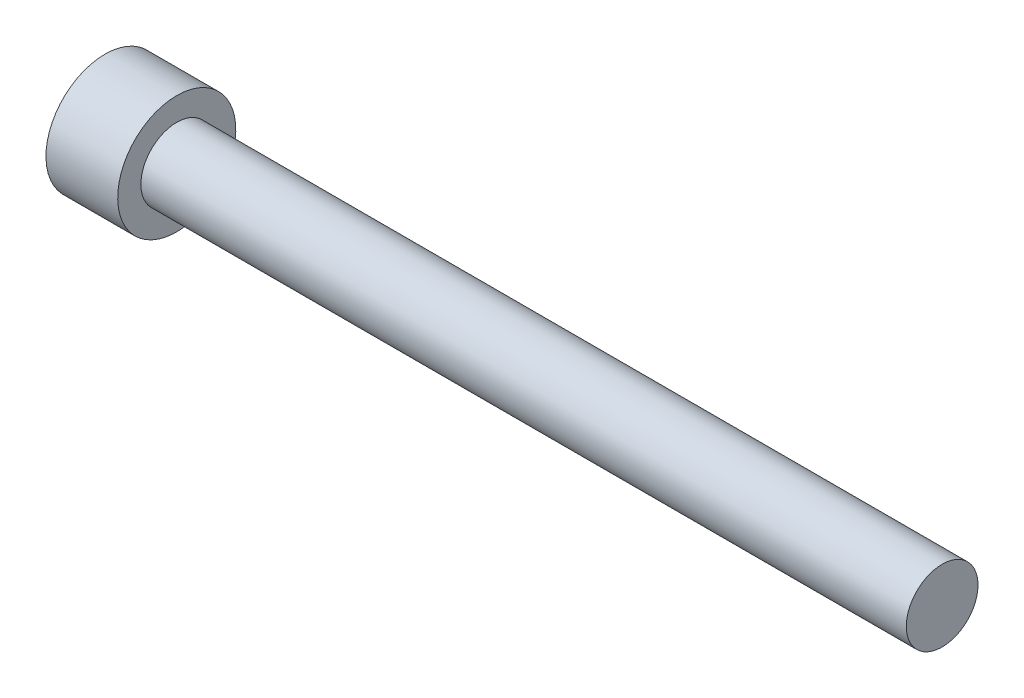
ISO-10303-21;
HEADER;
FILE_DESCRIPTION(('STEP AP214'),'2;1');
FILE_NAME('part.step','',(''),(''),'','','');
FILE_SCHEMA(('AUTOMOTIVE_DESIGN { 1 0 10303 214 1 1 1 1 }'));
ENDSEC;
DATA;
#1=APPLICATION_CONTEXT('core data for automotive mechanical design processes');
#2=APPLICATION_PROTOCOL_DEFINITION('international standard','automotive_design',2000,#1);
#3=PRODUCT_CONTEXT('',#1,'mechanical');
#4=PRODUCT('Part','Part','',(#3));
#5=PRODUCT_RELATED_PRODUCT_CATEGORY('part','',(#4));
#6=PRODUCT_DEFINITION_FORMATION('','',#4);
#7=PRODUCT_DEFINITION_CONTEXT('part definition',#1,'design');
#8=PRODUCT_DEFINITION('design','',#6,#7);
#9=PRODUCT_DEFINITION_SHAPE('','',#8);
#10=(LENGTH_UNIT() NAMED_UNIT(*) SI_UNIT(.MILLI.,.METRE.));
#11=(NAMED_UNIT(*) PLANE_ANGLE_UNIT() SI_UNIT($,.RADIAN.));
#12=(NAMED_UNIT(*) SI_UNIT($,.STERADIAN.) SOLID_ANGLE_UNIT());
#13=UNCERTAINTY_MEASURE_WITH_UNIT(LENGTH_MEASURE(1.E-05),#10,'distance_accuracy_value','');
#14=(GEOMETRIC_REPRESENTATION_CONTEXT(3) GLOBAL_UNCERTAINTY_ASSIGNED_CONTEXT((#13)) GLOBAL_UNIT_ASSIGNED_CONTEXT((#10,
#11,#12)) REPRESENTATION_CONTEXT('',''));
#15=CARTESIAN_POINT('',(0.,0.,0.));
#16=DIRECTION('',(0.,0.,1.));
#17=DIRECTION('',(1.,0.,0.));
#18=AXIS2_PLACEMENT_3D('',#15,#16,#17);
#19=CARTESIAN_POINT('',(48.6156,0.,0.));
#20=DIRECTION('',(1.,0.,0.));
#21=DIRECTION('',(0.,1.,0.));
#22=AXIS2_PLACEMENT_3D('',#19,#20,#21);
#23=PLANE('',#22);
#24=CARTESIAN_POINT('',(48.6156,0.,0.));
#25=DIRECTION('',(1.,0.,0.));
#26=DIRECTION('',(0.,1.,0.));
#27=AXIS2_PLACEMENT_3D('',#24,#25,#26);
#28=CIRCLE('',#27,2.08280000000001);
#29=CARTESIAN_POINT('',(48.6156,2.08280000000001,0.));
#30=VERTEX_POINT('',#29);
#31=EDGE_CURVE('E11',#30,#30,#28,.T.);
#32=ORIENTED_EDGE('',*,*,#31,.T.);
#33=EDGE_LOOP('',(#32));
#34=FACE_BOUND('',#33,.T.);
#35=ADVANCED_FACE('F380',(#34),#23,.T.);
#36=CARTESIAN_POINT('',(48.6156,0.,0.));
#37=DIRECTION('',(1.,0.,0.));
#38=DIRECTION('',(0.,1.,0.));
#39=AXIS2_PLACEMENT_3D('',#36,#37,#38);
#40=CYLINDRICAL_SURFACE('',#39,2.0828);
#41=CARTESIAN_POINT('',(4.1656,0.,0.));
#42=DIRECTION('',(1.,0.,0.));
#43=DIRECTION('',(0.,1.,0.));
#44=AXIS2_PLACEMENT_3D('',#41,#42,#43);
#45=CIRCLE('',#44,2.0828);
#46=CARTESIAN_POINT('',(4.1656,2.0828,0.));
#47=VERTEX_POINT('',#46);
#48=EDGE_CURVE('E387',#47,#47,#45,.T.);
#49=ORIENTED_EDGE('',*,*,#48,.T.);
#50=EDGE_LOOP('',(#49));
#51=FACE_BOUND('',#50,.T.);
#52=ORIENTED_EDGE('',*,*,#31,.F.);
#53=EDGE_LOOP('',(#52));
#54=FACE_BOUND('',#53,.T.);
#55=ADVANCED_FACE('F496',(#51,#54),#40,.T.);
#56=CARTESIAN_POINT('',(4.1656,3.429,0.));
#57=DIRECTION('',(1.,0.,0.));
#58=DIRECTION('',(0.,1.,0.));
#59=AXIS2_PLACEMENT_3D('',#56,#57,#58);
#60=PLANE('',#59);
#61=CARTESIAN_POINT('',(4.1656,0.,0.));
#62=DIRECTION('',(1.,0.,0.));
#63=DIRECTION('',(0.,1.,0.));
#64=AXIS2_PLACEMENT_3D('',#61,#62,#63);
#65=CIRCLE('',#64,3.429);
#66=CARTESIAN_POINT('',(4.1656,3.429,0.));
#67=VERTEX_POINT('',#66);
#68=EDGE_CURVE('E491',#67,#67,#65,.T.);
#69=ORIENTED_EDGE('',*,*,#68,.T.);
#70=EDGE_LOOP('',(#69));
#71=FACE_BOUND('',#70,.T.);
#72=ORIENTED_EDGE('',*,*,#48,.F.);
#73=EDGE_LOOP('',(#72));
#74=FACE_BOUND('',#73,.T.);
#75=ADVANCED_FACE('F499',(#71,#74),#60,.T.);
#76=CARTESIAN_POINT('',(48.6156,0.,0.));
#77=DIRECTION('',(1.,0.,0.));
#78=DIRECTION('',(0.,1.,0.));
#79=AXIS2_PLACEMENT_3D('',#76,#77,#78);
#80=CYLINDRICAL_SURFACE('',#79,3.429);
#81=CARTESIAN_POINT('',(0.,0.,0.));
#82=DIRECTION('',(1.,0.,0.));
#83=DIRECTION('',(0.,1.,0.));
#84=AXIS2_PLACEMENT_3D('',#81,#82,#83);
#85=CIRCLE('',#84,3.429);
#86=CARTESIAN_POINT('',(0.,3.429,0.));
#87=VERTEX_POINT('',#86);
#88=EDGE_CURVE('E482',#87,#87,#85,.T.);
#89=ORIENTED_EDGE('',*,*,#88,.T.);
#90=EDGE_LOOP('',(#89));
#91=FACE_BOUND('',#90,.T.);
#92=ORIENTED_EDGE('',*,*,#68,.F.);
#93=EDGE_LOOP('',(#92));
#94=FACE_BOUND('',#93,.T.);
#95=ADVANCED_FACE('F501',(#91,#94),#80,.T.);
#96=CARTESIAN_POINT('',(0.,0.,0.));
#97=DIRECTION('',(-1.,0.,0.));
#98=DIRECTION('',(0.,-1.,0.));
#99=AXIS2_PLACEMENT_3D('',#96,#97,#98);
#100=PLANE('',#99);
#101=DIRECTION('',(0.,0.866025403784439,0.5));
#102=VECTOR('',#101,1.);
#103=CARTESIAN_POINT('',(0.,-1.7859375,1.03111149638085));
#104=LINE('',#103,#102);
#105=CARTESIAN_POINT('',(0.,-1.7859375,1.03111149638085));
#106=VERTEX_POINT('',#105);
#107=CARTESIAN_POINT('',(0.,0.,2.06222299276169));
#108=VERTEX_POINT('',#107);
#109=EDGE_CURVE('E394',#106,#108,#104,.T.);
#110=ORIENTED_EDGE('',*,*,#109,.F.);
#111=DIRECTION('',(0.,0.,1.));
#112=VECTOR('',#111,1.);
#113=CARTESIAN_POINT('',(0.,-1.7859375,-1.03111149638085));
#114=LINE('',#113,#112);
#115=CARTESIAN_POINT('',(0.,-1.7859375,-1.03111149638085));
#116=VERTEX_POINT('',#115);
#117=EDGE_CURVE('E464',#116,#106,#114,.T.);
#118=ORIENTED_EDGE('',*,*,#117,.F.);
#119=DIRECTION('',(0.,-0.866025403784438,0.5));
#120=VECTOR('',#119,1.);
#121=CARTESIAN_POINT('',(0.,0.,-2.06222299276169));
#122=LINE('',#121,#120);
#123=CARTESIAN_POINT('',(0.,0.,-2.06222299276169));
#124=VERTEX_POINT('',#123);
#125=EDGE_CURVE('E458',#124,#116,#122,.T.);
#126=ORIENTED_EDGE('',*,*,#125,.F.);
#127=DIRECTION('',(0.,-0.866025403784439,-0.499999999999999));
#128=VECTOR('',#127,1.);
#129=CARTESIAN_POINT('',(0.,1.7859375,-1.03111149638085));
#130=LINE('',#129,#128);
#131=CARTESIAN_POINT('',(0.,1.7859375,-1.03111149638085));
#132=VERTEX_POINT('',#131);
#133=EDGE_CURVE('E456',#132,#124,#130,.T.);
#134=ORIENTED_EDGE('',*,*,#133,.F.);
#135=DIRECTION('',(0.,0.,-1.));
#136=VECTOR('',#135,1.);
#137=CARTESIAN_POINT('',(0.,1.7859375,1.03111149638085));
#138=LINE('',#137,#136);
#139=CARTESIAN_POINT('',(0.,1.7859375,1.03111149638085));
#140=VERTEX_POINT('',#139);
#141=EDGE_CURVE('E437',#140,#132,#138,.T.);
#142=ORIENTED_EDGE('',*,*,#141,.F.);
#143=DIRECTION('',(0.,0.866025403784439,-0.5));
#144=VECTOR('',#143,1.);
#145=CARTESIAN_POINT('',(0.,0.,2.06222299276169));
#146=LINE('',#145,#144);
#147=EDGE_CURVE('E448',#108,#140,#146,.T.);
#148=ORIENTED_EDGE('',*,*,#147,.F.);
#149=EDGE_LOOP('',(#110,#118,#126,#134,#142,#148));
#150=FACE_BOUND('',#149,.T.);
#151=ORIENTED_EDGE('',*,*,#88,.F.);
#152=EDGE_LOOP('',(#151));
#153=FACE_BOUND('',#152,.T.);
#154=ADVANCED_FACE('F452',(#150,#153),#100,.T.);
#155=CARTESIAN_POINT('',(4.826,-1.7859375,1.03111149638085));
#156=DIRECTION('',(0.,-0.5,0.866025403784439));
#157=DIRECTION('',(0.,-0.866025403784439,-0.5));
#158=AXIS2_PLACEMENT_3D('',#155,#156,#157);
#159=PLANE('',#158);
#160=ORIENTED_EDGE('',*,*,#109,.T.);
#161=DIRECTION('',(-1.,0.,0.));
#162=VECTOR('',#161,1.);
#163=CARTESIAN_POINT('',(4.826,0.,2.06222299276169));
#164=LINE('',#163,#162);
#165=CARTESIAN_POINT('',(4.826,0.,2.06222299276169));
#166=VERTEX_POINT('',#165);
#167=EDGE_CURVE('E445',#166,#108,#164,.T.);
#168=ORIENTED_EDGE('',*,*,#167,.F.);
#169=DIRECTION('',(0.,0.866025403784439,0.5));
#170=VECTOR('',#169,1.);
#171=CARTESIAN_POINT('',(4.826,-1.7859375,1.03111149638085));
#172=LINE('',#171,#170);
#173=CARTESIAN_POINT('',(4.826,-1.7859375,1.03111149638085));
#174=VERTEX_POINT('',#173);
#175=EDGE_CURVE('E466',#174,#166,#172,.T.);
#176=ORIENTED_EDGE('',*,*,#175,.F.);
#177=DIRECTION('',(-1.,0.,0.));
#178=VECTOR('',#177,1.);
#179=CARTESIAN_POINT('',(4.826,-1.7859375,1.03111149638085));
#180=LINE('',#179,#178);
#181=EDGE_CURVE('E401',#174,#106,#180,.T.);
#182=ORIENTED_EDGE('',*,*,#181,.T.);
#183=EDGE_LOOP('',(#160,#168,#176,#182));
#184=FACE_BOUND('',#183,.T.);
#185=ADVANCED_FACE('F532',(#184),#159,.F.);
#186=CARTESIAN_POINT('',(4.826,-1.7859375,-1.03111149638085));
#187=DIRECTION('',(0.,-1.,0.));
#188=DIRECTION('',(1.,0.,0.));
#189=AXIS2_PLACEMENT_3D('',#186,#187,#188);
#190=PLANE('',#189);
#191=ORIENTED_EDGE('',*,*,#117,.T.);
#192=ORIENTED_EDGE('',*,*,#181,.F.);
#193=DIRECTION('',(0.,0.,1.));
#194=VECTOR('',#193,1.);
#195=CARTESIAN_POINT('',(4.826,-1.7859375,-1.03111149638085));
#196=LINE('',#195,#194);
#197=CARTESIAN_POINT('',(4.826,-1.7859375,-1.03111149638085));
#198=VERTEX_POINT('',#197);
#199=EDGE_CURVE('E478',#198,#174,#196,.T.);
#200=ORIENTED_EDGE('',*,*,#199,.F.);
#201=DIRECTION('',(-1.,0.,0.));
#202=VECTOR('',#201,1.);
#203=CARTESIAN_POINT('',(4.826,-1.7859375,-1.03111149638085));
#204=LINE('',#203,#202);
#205=EDGE_CURVE('E483',#198,#116,#204,.T.);
#206=ORIENTED_EDGE('',*,*,#205,.T.);
#207=EDGE_LOOP('',(#191,#192,#200,#206));
#208=FACE_BOUND('',#207,.T.);
#209=ADVANCED_FACE('F539',(#208),#190,.F.);
#210=CARTESIAN_POINT('',(4.826,0.,-2.06222299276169));
#211=DIRECTION('',(0.,-0.5,-0.866025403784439));
#212=DIRECTION('',(0.,0.866025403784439,-0.5));
#213=AXIS2_PLACEMENT_3D('',#210,#211,#212);
#214=PLANE('',#213);
#215=ORIENTED_EDGE('',*,*,#125,.T.);
#216=ORIENTED_EDGE('',*,*,#205,.F.);
#217=DIRECTION('',(0.,-0.866025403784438,0.5));
#218=VECTOR('',#217,1.);
#219=CARTESIAN_POINT('',(4.826,0.,-2.06222299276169));
#220=LINE('',#219,#218);
#221=CARTESIAN_POINT('',(4.826,0.,-2.06222299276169));
#222=VERTEX_POINT('',#221);
#223=EDGE_CURVE('E475',#222,#198,#220,.T.);
#224=ORIENTED_EDGE('',*,*,#223,.F.);
#225=DIRECTION('',(-1.,0.,0.));
#226=VECTOR('',#225,1.);
#227=CARTESIAN_POINT('',(4.826,0.,-2.06222299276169));
#228=LINE('',#227,#226);
#229=EDGE_CURVE('E485',#222,#124,#228,.T.);
#230=ORIENTED_EDGE('',*,*,#229,.T.);
#231=EDGE_LOOP('',(#215,#216,#224,#230));
#232=FACE_BOUND('',#231,.T.);
#233=ADVANCED_FACE('F546',(#232),#214,.F.);
#234=CARTESIAN_POINT('',(4.826,1.7859375,-1.03111149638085));
#235=DIRECTION('',(0.,0.499999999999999,-0.866025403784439));
#236=DIRECTION('',(0.,0.866025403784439,0.499999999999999));
#237=AXIS2_PLACEMENT_3D('',#234,#235,#236);
#238=PLANE('',#237);
#239=ORIENTED_EDGE('',*,*,#133,.T.);
#240=ORIENTED_EDGE('',*,*,#229,.F.);
#241=DIRECTION('',(0.,-0.866025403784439,-0.499999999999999));
#242=VECTOR('',#241,1.);
#243=CARTESIAN_POINT('',(4.826,1.7859375,-1.03111149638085));
#244=LINE('',#243,#242);
#245=CARTESIAN_POINT('',(4.826,1.7859375,-1.03111149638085));
#246=VERTEX_POINT('',#245);
#247=EDGE_CURVE('E472',#246,#222,#244,.T.);
#248=ORIENTED_EDGE('',*,*,#247,.F.);
#249=DIRECTION('',(-1.,0.,0.));
#250=VECTOR('',#249,1.);
#251=CARTESIAN_POINT('',(4.826,1.7859375,-1.03111149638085));
#252=LINE('',#251,#250);
#253=EDGE_CURVE('E444',#246,#132,#252,.T.);
#254=ORIENTED_EDGE('',*,*,#253,.T.);
#255=EDGE_LOOP('',(#239,#240,#248,#254));
#256=FACE_BOUND('',#255,.T.);
#257=ADVANCED_FACE('F553',(#256),#238,.F.);
#258=CARTESIAN_POINT('',(4.826,1.7859375,1.03111149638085));
#259=DIRECTION('',(0.,1.,0.));
#260=DIRECTION('',(-1.,0.,0.));
#261=AXIS2_PLACEMENT_3D('',#258,#259,#260);
#262=PLANE('',#261);
#263=ORIENTED_EDGE('',*,*,#141,.T.);
#264=ORIENTED_EDGE('',*,*,#253,.F.);
#265=DIRECTION('',(0.,0.,-1.));
#266=VECTOR('',#265,1.);
#267=CARTESIAN_POINT('',(4.826,1.7859375,1.03111149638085));
#268=LINE('',#267,#266);
#269=CARTESIAN_POINT('',(4.826,1.7859375,1.03111149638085));
#270=VERTEX_POINT('',#269);
#271=EDGE_CURVE('E440',#270,#246,#268,.T.);
#272=ORIENTED_EDGE('',*,*,#271,.F.);
#273=DIRECTION('',(-1.,0.,0.));
#274=VECTOR('',#273,1.);
#275=CARTESIAN_POINT('',(4.826,1.7859375,1.03111149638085));
#276=LINE('',#275,#274);
#277=EDGE_CURVE('E433',#270,#140,#276,.T.);
#278=ORIENTED_EDGE('',*,*,#277,.T.);
#279=EDGE_LOOP('',(#263,#264,#272,#278));
#280=FACE_BOUND('',#279,.T.);
#281=ADVANCED_FACE('F435',(#280),#262,.F.);
#282=CARTESIAN_POINT('',(4.826,0.,2.06222299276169));
#283=DIRECTION('',(0.,0.5,0.866025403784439));
#284=DIRECTION('',(0.,-0.866025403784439,0.5));
#285=AXIS2_PLACEMENT_3D('',#282,#283,#284);
#286=PLANE('',#285);
#287=ORIENTED_EDGE('',*,*,#147,.T.);
#288=ORIENTED_EDGE('',*,*,#277,.F.);
#289=DIRECTION('',(0.,0.866025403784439,-0.5));
#290=VECTOR('',#289,1.);
#291=CARTESIAN_POINT('',(4.826,0.,2.06222299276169));
#292=LINE('',#291,#290);
#293=EDGE_CURVE('E469',#166,#270,#292,.T.);
#294=ORIENTED_EDGE('',*,*,#293,.F.);
#295=ORIENTED_EDGE('',*,*,#167,.T.);
#296=EDGE_LOOP('',(#287,#288,#294,#295));
#297=FACE_BOUND('',#296,.T.);
#298=ADVANCED_FACE('F449',(#297),#286,.F.);
#299=CARTESIAN_POINT('',(4.826,1.7859375,3.09333448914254));
#300=DIRECTION('',(-1.,0.,0.));
#301=DIRECTION('',(0.,-1.,0.));
#302=AXIS2_PLACEMENT_3D('',#299,#300,#301);
#303=PLANE('',#302);
#304=ORIENTED_EDGE('',*,*,#175,.T.);
#305=ORIENTED_EDGE('',*,*,#293,.T.);
#306=ORIENTED_EDGE('',*,*,#271,.T.);
#307=ORIENTED_EDGE('',*,*,#247,.T.);
#308=ORIENTED_EDGE('',*,*,#223,.T.);
#309=ORIENTED_EDGE('',*,*,#199,.T.);
#310=EDGE_LOOP('',(#304,#305,#306,#307,#308,#309));
#311=FACE_BOUND('',#310,.T.);
#312=ADVANCED_FACE('F574',(#311),#303,.T.);
#313=CLOSED_SHELL('',(#35,#55,#75,#95,#154,#185,#209,#233,#257,#281,#298,#312));
#314=MANIFOLD_SOLID_BREP('B2',#313);
#315=ADVANCED_BREP_SHAPE_REPRESENTATION('',(#18,#314),#14);
#316=SHAPE_DEFINITION_REPRESENTATION(#9,#315);
ENDSEC;
END-ISO-10303-21;
